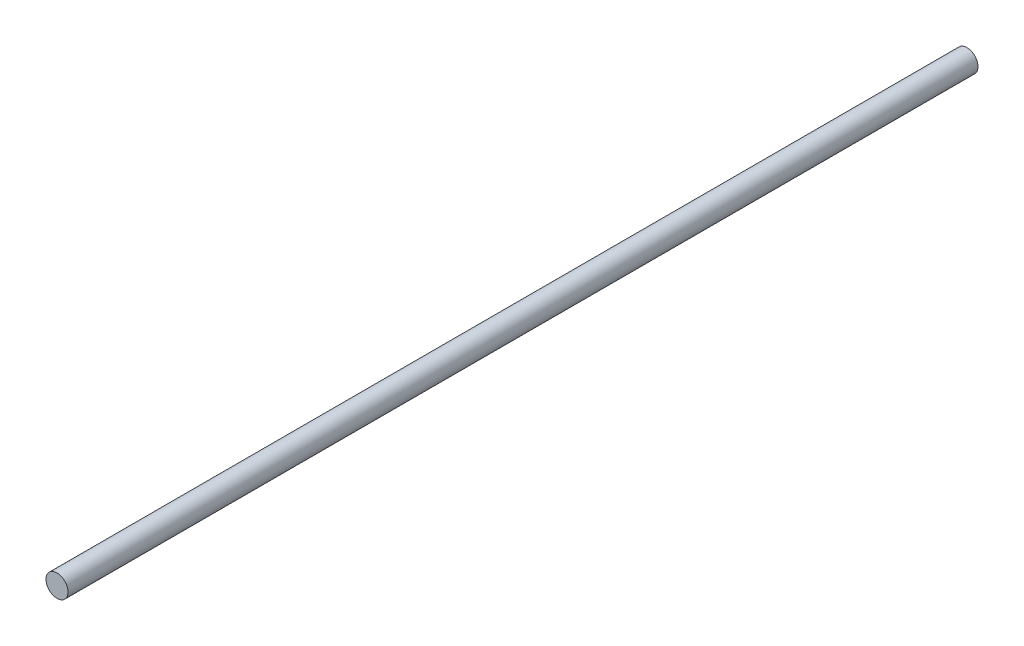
from build123d import *

# Parameters (mm, degrees)
SKETCH1_R           = 4
BOSS_EXTRUDE1_DEPTH = 330


with BuildPart() as part:
    # Sketch1 → Boss-Extrude1 (new body)
    with BuildSketch(Plane.XY):
        with Locations((-22.770422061, -254.782156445)):
            Circle(SKETCH1_R)
    extrude(amount=BOSS_EXTRUDE1_DEPTH)


solid = part.part
